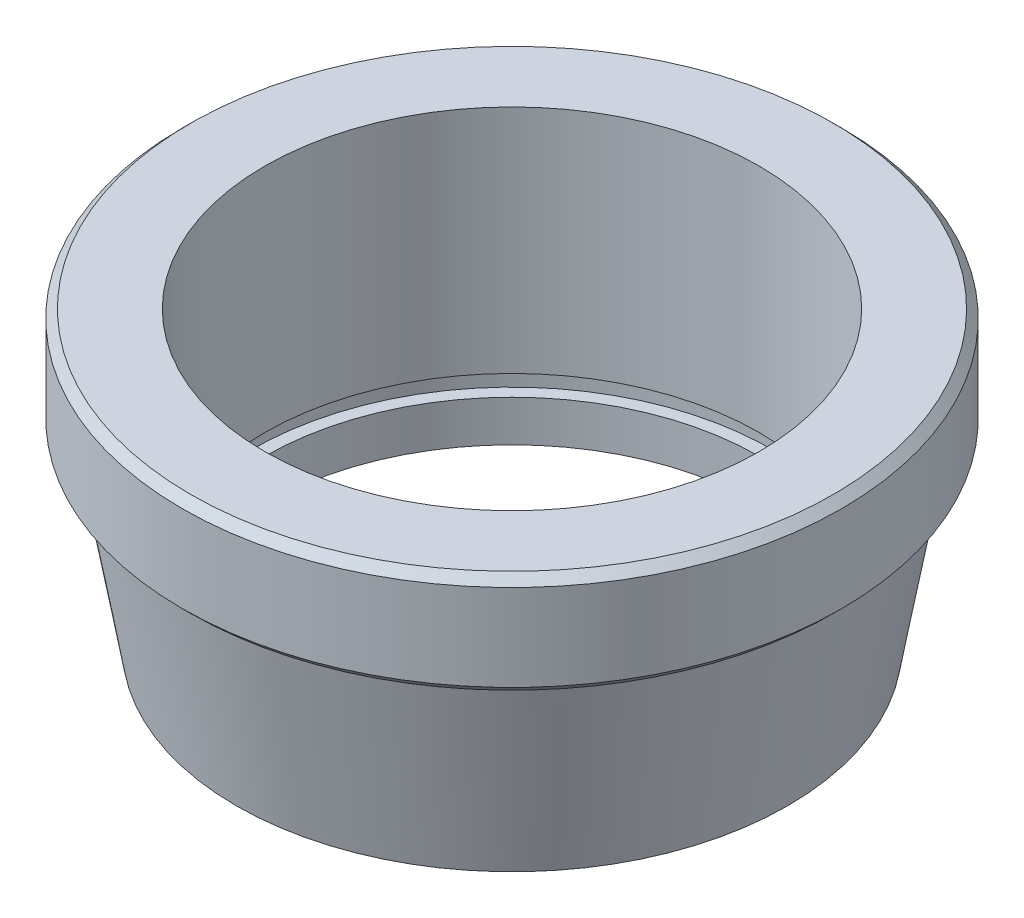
from build123d import *

# Parameters (mm, degrees)
SKICA1_R                 = 7.5
P_IDAT_VYSUNUT_M1_DEPTH  = 4.6
P_IDAT_VYSUNUT_M1_DRAFT  = -10
SKICA2_R                 = 8
P_IDAT_VYSUNUT_M2_DEPTH  = 2.5
ZKOSEN_1_SIZE            = 0.2
SKICA3_R                 = 6
ODEBRAT_VYSUNUT_M1_DEPTH = 2.5
ODEBRAT_START            = -4.6
SKICA4_R                 = 6
ODEBRAT_VYSUNUT_M2_DEPTH = 4.6
SKICA5_W                 = 0.3
SKICA5_H                 = 0.5


with BuildPart() as part:
    # Skica1 → P_idat vysunut_m1 (with draft: the straight prism first)
    with BuildSketch(Plane(origin=(0, 0, 0), x_dir=(1, 0, 0), z_dir=(0, 1, 0))):
        Circle(SKICA1_R)
    extrude(amount=-P_IDAT_VYSUNUT_M1_DEPTH)
    # P_idat vysunut_m1: the draft: its side faces are tilted about the plane it starts from
    p_idat_vysunut_m1_sides = [part.faces().sort_by_distance(p)[0] for p in [
        (-7.5, -2.3, 0),
    ]]
    draft(p_idat_vysunut_m1_sides, Plane(origin=(0, 0, 0), x_dir=(1, 0, 0), z_dir=(0, 1, 0)), P_IDAT_VYSUNUT_M1_DRAFT)

    # Skica2 → P_idat vysunut_m2 (add)
    with BuildSketch(Plane(origin=(0, 0, 0), x_dir=(-1, 0, 0), z_dir=(0, 1, 0))):
        with Locations(Location((0, 0, 0), (0, 0, 90))):
            Circle(SKICA2_R)
    extrude(amount=P_IDAT_VYSUNUT_M2_DEPTH)

    # Zkosen_1
    zkosen_1_edges = [part.edges().sort_by_distance(p)[0] for p in [
        (0, 0, -8),
        (0, 2.5, -8),
    ]]
    chamfer(zkosen_1_edges, length=ZKOSEN_1_SIZE)

    # Skica3 → Odebrat vysunut_m1 (cut)
    with BuildSketch(Plane(origin=(0, 2.5, 0), x_dir=(1, 0, 0), z_dir=(0, 1, 0))):
        with Locations(Location((0, 0, 0), (0, 0, 270))):
            Circle(SKICA3_R)
    extrude(amount=-ODEBRAT_VYSUNUT_M1_DEPTH, mode=Mode.SUBTRACT)

    # Skica4 → Odebrat vysunut_m2 (cut)
    with BuildSketch(Plane.XZ.offset(4.6).offset(ODEBRAT_START)):
        with Locations(Location((0, 0, 0), (0, 0, 90))):
            Circle(SKICA4_R)
    extrude(amount=ODEBRAT_VYSUNUT_M2_DEPTH, mode=Mode.SUBTRACT)

    # Skica5 → Odebrat rotac_1 (revolve, cut)
    with BuildSketch(Plane.XY, mode=Mode.PRIVATE) as odebrat_rotac_1_sk:
        with Locations((-6.15, -3.35)):
            Rectangle(SKICA5_W, SKICA5_H)
    revolve(odebrat_rotac_1_sk.sketch.rotate(Axis((0, 2.5, 0), (0, -1, 0)), 270), axis=Axis((0, 2.5, 0), (0, -1, 0)), mode=Mode.SUBTRACT)


solid = part.part
